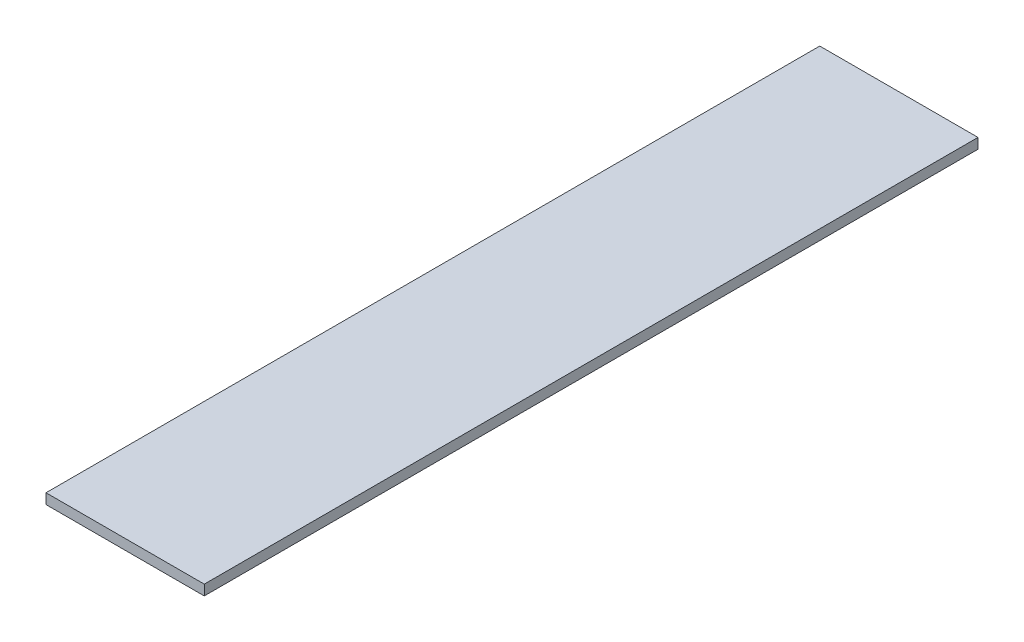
from build123d import *

# Parameters (mm, degrees)
SKETCH1_W           = 85.725
SKETCH1_H           = 419.1
BOSS_EXTRUDE1_DEPTH = 5.55625


with BuildPart() as part:
    # Sketch1 → Boss-Extrude1 (new body)
    with BuildSketch(Plane(origin=(0, 0, 0), x_dir=(1, 0, 0), z_dir=(0, 1, 0))):
        Rectangle(SKETCH1_W, SKETCH1_H)
    extrude(amount=BOSS_EXTRUDE1_DEPTH)


solid = part.part
